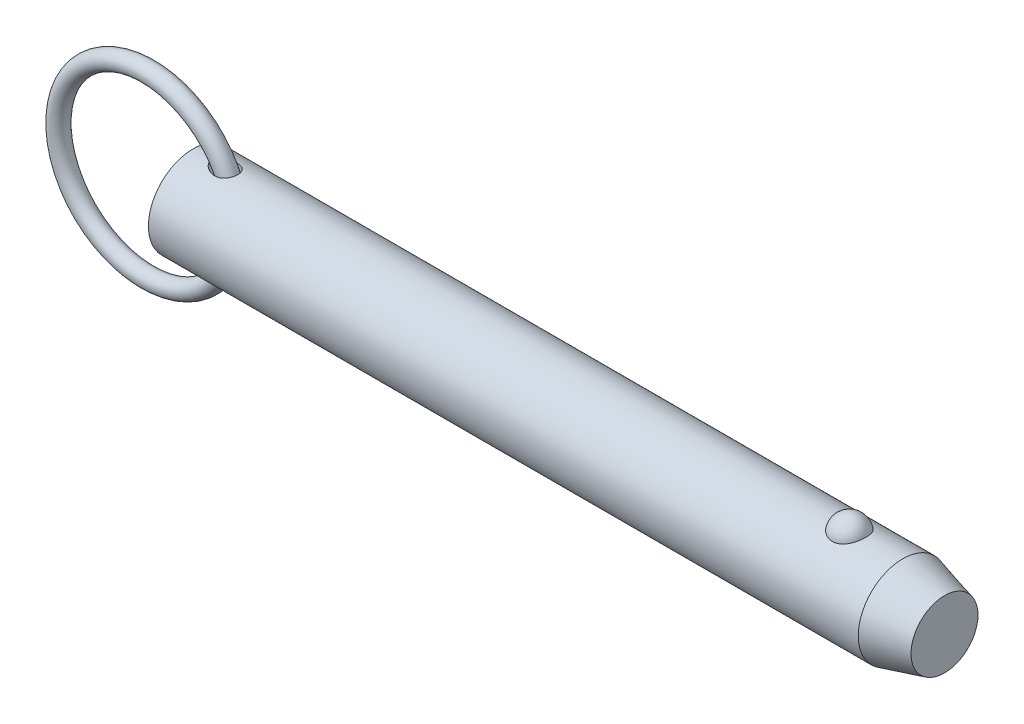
ISO-10303-21;
HEADER;
FILE_DESCRIPTION(('STEP AP214'),'2;1');
FILE_NAME('part.step','',(''),(''),'','','');
FILE_SCHEMA(('AUTOMOTIVE_DESIGN { 1 0 10303 214 1 1 1 1 }'));
ENDSEC;
DATA;
#1=APPLICATION_CONTEXT('core data for automotive mechanical design processes');
#2=APPLICATION_PROTOCOL_DEFINITION('international standard','automotive_design',2000,#1);
#3=PRODUCT_CONTEXT('',#1,'mechanical');
#4=PRODUCT('Part','Part','',(#3));
#5=PRODUCT_RELATED_PRODUCT_CATEGORY('part','',(#4));
#6=PRODUCT_DEFINITION_FORMATION('','',#4);
#7=PRODUCT_DEFINITION_CONTEXT('part definition',#1,'design');
#8=PRODUCT_DEFINITION('design','',#6,#7);
#9=PRODUCT_DEFINITION_SHAPE('','',#8);
#10=(LENGTH_UNIT() NAMED_UNIT(*) SI_UNIT(.MILLI.,.METRE.));
#11=(NAMED_UNIT(*) PLANE_ANGLE_UNIT() SI_UNIT($,.RADIAN.));
#12=(NAMED_UNIT(*) SI_UNIT($,.STERADIAN.) SOLID_ANGLE_UNIT());
#13=UNCERTAINTY_MEASURE_WITH_UNIT(LENGTH_MEASURE(1.E-05),#10,'distance_accuracy_value','');
#14=(GEOMETRIC_REPRESENTATION_CONTEXT(3) GLOBAL_UNCERTAINTY_ASSIGNED_CONTEXT((#13)) GLOBAL_UNIT_ASSIGNED_CONTEXT((#10,
#11,#12)) REPRESENTATION_CONTEXT('',''));
#15=CARTESIAN_POINT('',(0.,0.,0.));
#16=DIRECTION('',(0.,0.,1.));
#17=DIRECTION('',(1.,0.,0.));
#18=AXIS2_PLACEMENT_3D('',#15,#16,#17);
#19=CARTESIAN_POINT('',(-9.66825126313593,0.,0.));
#20=DIRECTION('',(0.,0.,1.));
#21=DIRECTION('',(1.,0.,0.));
#22=AXIS2_PLACEMENT_3D('',#19,#20,#21);
#23=TOROIDAL_SURFACE('',#22,19.05,1.905);
#24=CARTESIAN_POINT('',(11.2867487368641,0.,0.));
#25=VERTEX_POINT('',#24);
#26=VERTEX_LOOP('',#25);
#27=FACE_BOUND('',#26,.T.);
#28=ADVANCED_FACE('P0_F12',(#27),#23,.T.);
#29=CLOSED_SHELL('',(#28));
#30=MANIFOLD_SOLID_BREP('P0_B1',#29);
#31=CARTESIAN_POINT('',(0.,0.,0.));
#32=DIRECTION('',(1.,0.,0.));
#33=DIRECTION('',(0.,0.,-1.));
#34=AXIS2_PLACEMENT_3D('',#31,#32,#33);
#35=CYLINDRICAL_SURFACE('',#34,9.525);
#36=CARTESIAN_POINT('',(4.5669340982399,9.4314194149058,-1.33189820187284));
#37=CARTESIAN_POINT('',(4.70260475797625,9.41020313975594,-1.48215931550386));
#38=CARTESIAN_POINT('',(4.85555680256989,9.38755003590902,-1.61683982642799));
#39=CARTESIAN_POINT('',(5.10171959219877,9.35450554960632,-1.79512943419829));
#40=CARTESIAN_POINT('',(5.18674514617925,9.34362629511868,-1.85068909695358));
#41=CARTESIAN_POINT('',(5.3615438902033,9.32258514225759,-1.95392002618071));
#42=CARTESIAN_POINT('',(5.45131542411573,9.31242299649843,-2.00159402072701));
#43=CARTESIAN_POINT('',(5.70070211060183,9.28632120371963,-2.12033289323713));
#44=CARTESIAN_POINT('',(5.86420408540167,9.2714693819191,-2.18362944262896));
#45=CARTESIAN_POINT('',(6.19893345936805,9.24694163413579,-2.28525783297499));
#46=CARTESIAN_POINT('',(6.37015384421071,9.23726110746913,-2.32361187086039));
#47=CARTESIAN_POINT('',(6.73531776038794,9.22400982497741,-2.37575048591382));
#48=CARTESIAN_POINT('',(6.92975826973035,9.22118808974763,-2.38652934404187));
#49=CARTESIAN_POINT('',(7.21995443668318,9.22416297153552,-2.37494980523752));
#50=CARTESIAN_POINT('',(7.31643847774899,9.22635560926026,-2.366466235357));
#51=CARTESIAN_POINT('',(7.50796421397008,9.2331428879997,-2.33985028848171));
#52=CARTESIAN_POINT('',(7.6030065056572,9.23773650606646,-2.32172202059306));
#53=CARTESIAN_POINT('',(7.83273114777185,9.25183311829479,-2.26504721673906));
#54=CARTESIAN_POINT('',(7.96603028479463,9.26261470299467,-2.2209856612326));
#55=CARTESIAN_POINT('',(8.22310899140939,9.28816519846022,-2.11157306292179));
#56=CARTESIAN_POINT('',(8.34689477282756,9.30293147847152,-2.04623606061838));
#57=CARTESIAN_POINT('',(8.58136049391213,9.3349416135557,-1.89485344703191));
#58=CARTESIAN_POINT('',(8.69199721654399,9.35219324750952,-1.80874222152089));
#59=CARTESIAN_POINT('',(8.89592093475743,9.38707016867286,-1.6179918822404));
#60=CARTESIAN_POINT('',(8.98920771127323,9.40469546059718,-1.51335253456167));
#61=CARTESIAN_POINT('',(9.15057731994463,9.43713590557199,-1.29519427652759));
#62=CARTESIAN_POINT('',(9.21980158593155,9.45205440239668,-1.18253282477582));
#63=CARTESIAN_POINT('',(9.33826736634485,9.47856708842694,-0.946802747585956));
#64=CARTESIAN_POINT('',(9.38751161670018,9.49016173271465,-0.823735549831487));
#65=CARTESIAN_POINT('',(9.46423850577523,9.50859378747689,-0.572614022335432));
#66=CARTESIAN_POINT('',(9.49202393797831,9.5154972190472,-0.444656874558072));
#67=CARTESIAN_POINT('',(9.52636926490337,9.5240690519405,-0.18575268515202));
#68=CARTESIAN_POINT('',(9.53292923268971,9.52573747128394,-0.0548056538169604));
#69=CARTESIAN_POINT('',(9.52467276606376,9.52365852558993,0.206503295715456));
#70=CARTESIAN_POINT('',(9.50983454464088,9.51990564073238,0.33686448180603));
#71=CARTESIAN_POINT('',(9.45907362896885,9.50737852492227,0.593166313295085));
#72=CARTESIAN_POINT('',(9.42315106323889,9.49860432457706,0.719106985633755));
#73=CARTESIAN_POINT('',(9.33106648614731,9.4769892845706,0.962959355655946));
#74=CARTESIAN_POINT('',(9.27490839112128,9.46414923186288,1.08087260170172));
#75=CARTESIAN_POINT('',(9.14375803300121,9.43581000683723,1.30534632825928));
#76=CARTESIAN_POINT('',(9.06876720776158,9.42031103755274,1.41190767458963));
#77=CARTESIAN_POINT('',(8.90203187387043,9.38836719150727,1.61069439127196));
#78=CARTESIAN_POINT('',(8.81029913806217,9.37192298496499,1.70292975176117));
#79=CARTESIAN_POINT('',(8.61268775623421,9.33985045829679,1.87086859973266));
#80=CARTESIAN_POINT('',(8.50680947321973,9.3242221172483,1.94657251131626));
#81=CARTESIAN_POINT('',(8.28220546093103,9.29513431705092,2.08109032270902));
#82=CARTESIAN_POINT('',(8.16329919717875,9.28171415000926,2.13961034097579));
#83=CARTESIAN_POINT('',(7.91756052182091,9.25859072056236,2.23755716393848));
#84=CARTESIAN_POINT('',(7.79072606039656,9.24888842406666,2.27697900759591));
#85=CARTESIAN_POINT('',(7.52377913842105,9.23338749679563,2.33907806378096));
#86=CARTESIAN_POINT('',(7.38334767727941,9.22789571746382,2.36044900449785));
#87=CARTESIAN_POINT('',(7.10081394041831,9.22210229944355,2.3829751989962));
#88=CARTESIAN_POINT('',(6.95871103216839,9.22180269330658,2.38412253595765));
#89=CARTESIAN_POINT('',(6.65642691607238,9.22632724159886,2.36656230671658));
#90=CARTESIAN_POINT('',(6.49641694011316,9.23185415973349,2.3451317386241));
#91=CARTESIAN_POINT('',(6.18115433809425,9.24811737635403,2.28014143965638));
#92=CARTESIAN_POINT('',(6.02590710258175,9.25885936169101,2.23655754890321));
#93=CARTESIAN_POINT('',(5.69904720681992,9.28624254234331,2.12025087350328));
#94=CARTESIAN_POINT('',(5.52873601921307,9.30354853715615,2.04400672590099));
#95=CARTESIAN_POINT('',(5.20289495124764,9.34106989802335,1.86504730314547));
#96=CARTESIAN_POINT('',(5.04735968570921,9.36128419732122,1.76234172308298));
#97=CARTESIAN_POINT('',(4.7928712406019,9.39697639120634,1.55895334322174));
#98=CARTESIAN_POINT('',(4.68938704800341,9.41240250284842,1.46392900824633));
#99=CARTESIAN_POINT('',(4.4984714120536,9.44202586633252,1.25875918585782));
#100=CARTESIAN_POINT('',(4.41101129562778,9.45622528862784,1.1486413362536));
#101=CARTESIAN_POINT('',(4.27502257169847,9.47888210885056,0.940600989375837));
#102=CARTESIAN_POINT('',(4.22216329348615,9.48791121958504,0.84558680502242));
#103=CARTESIAN_POINT('',(4.1324147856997,9.50344321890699,0.648051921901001));
#104=CARTESIAN_POINT('',(4.0955118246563,9.50994827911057,0.545537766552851));
#105=CARTESIAN_POINT('',(4.04043124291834,9.51971586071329,0.334452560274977));
#106=CARTESIAN_POINT('',(4.02240728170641,9.52295176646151,0.22583927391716));
#107=CARTESIAN_POINT('',(4.00750873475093,9.52562364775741,0.00713006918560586));
#108=CARTESIAN_POINT('',(4.01062334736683,9.52506156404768,-0.102965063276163));
#109=CARTESIAN_POINT('',(4.03592967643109,9.52053221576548,-0.306944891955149));
#110=CARTESIAN_POINT('',(4.05571676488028,9.51699426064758,-0.401151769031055));
#111=CARTESIAN_POINT('',(4.10967975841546,9.5074546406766,-0.585176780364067));
#112=CARTESIAN_POINT('',(4.1438599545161,9.50145224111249,-0.674993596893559));
#113=CARTESIAN_POINT('',(4.23261356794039,9.48611703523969,-0.866116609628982));
#114=CARTESIAN_POINT('',(4.28990016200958,9.47635800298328,-0.966121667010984));
#115=CARTESIAN_POINT('',(4.41856577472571,9.45502867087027,-1.15640011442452));
#116=CARTESIAN_POINT('',(4.48996918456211,9.44345524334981,-1.24665623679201));
#117=CARTESIAN_POINT('',(4.5669340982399,9.4314194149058,-1.33189820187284));
#118=B_SPLINE_CURVE_WITH_KNOTS('',3,(#36,#37,#38,#39,#40,#41,#42,#43,#44,#45,#46,#47,#48,#49,
#50,#51,#52,#53,#54,#55,#56,#57,#58,#59,#60,#61,#62,#63,#64,#65,#66,#67,#68,#69,#70,#71,#72,#73,
#74,#75,#76,#77,#78,#79,#80,#81,#82,#83,#84,#85,#86,#87,#88,#89,#90,#91,#92,#93,#94,#95,#96,#97,
#98,#99,#100,#101,#102,#103,#104,#105,#106,#107,#108,#109,#110,#111,#112,#113,#114,#115,#116,
#117),.UNSPECIFIED.,.T.,.F.,(4,2,2,2,2,2,2,2,2,2,2,2,2,2,2,2,2,2,2,2,2,2,2,2,2,2,2,2,2,2,2,2,2,
2,2,2,2,2,2,2,4),(0.,0.609951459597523,0.916123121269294,1.22218863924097,1.74791337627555,
2.27316961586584,2.85362722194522,3.14383229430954,3.43391382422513,3.85437497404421,
4.27455920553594,4.69608835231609,5.11762282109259,5.5149005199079,5.91212379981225,
6.30363414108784,6.69514313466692,7.08705103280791,7.47895654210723,7.87078624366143,
8.26258603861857,8.65411137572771,9.04562666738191,9.44349251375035,9.84146165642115,
10.2662286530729,10.6911619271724,11.1739180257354,11.6572017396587,12.2170157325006,
12.776624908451,13.1992556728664,13.6211226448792,13.9471990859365,14.2729943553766,
14.6014211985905,14.9296802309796,15.2173810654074,15.505167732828,15.8505863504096,
16.1966070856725),.UNSPECIFIED.);
#119=CARTESIAN_POINT('',(4.5669340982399,9.4314194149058,-1.33189820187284));
#120=VERTEX_POINT('',#119);
#121=EDGE_CURVE('P1_E40',#120,#120,#118,.T.);
#122=ORIENTED_EDGE('',*,*,#121,.T.);
#123=EDGE_LOOP('',(#122));
#124=FACE_BOUND('',#123,.T.);
#125=CARTESIAN_POINT('',(151.443054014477,0.,0.));
#126=DIRECTION('',(1.,0.,0.));
#127=DIRECTION('',(0.,0.,-1.));
#128=AXIS2_PLACEMENT_3D('',#125,#126,#127);
#129=CIRCLE('',#128,9.525);
#130=CARTESIAN_POINT('',(151.443054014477,0.,-9.525));
#131=VERTEX_POINT('',#130);
#132=EDGE_CURVE('P1_E25',#131,#131,#129,.T.);
#133=ORIENTED_EDGE('',*,*,#132,.F.);
#134=EDGE_LOOP('',(#133));
#135=FACE_BOUND('',#134,.T.);
#136=CARTESIAN_POINT('',(0.,0.,0.));
#137=DIRECTION('',(1.,0.,0.));
#138=DIRECTION('',(0.,0.,-1.));
#139=AXIS2_PLACEMENT_3D('',#136,#137,#138);
#140=CIRCLE('',#139,9.525);
#141=CARTESIAN_POINT('',(0.,0.,-9.525));
#142=VERTEX_POINT('',#141);
#143=EDGE_CURVE('P1_E9',#142,#142,#140,.T.);
#144=ORIENTED_EDGE('',*,*,#143,.T.);
#145=EDGE_LOOP('',(#144));
#146=FACE_BOUND('',#145,.T.);
#147=CARTESIAN_POINT('',(140.045757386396,8.80405803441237,3.63513233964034));
#148=CARTESIAN_POINT('',(139.951676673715,8.80405953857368,3.63513053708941));
#149=CARTESIAN_POINT('',(139.857561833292,8.80561325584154,3.63137461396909));
#150=CARTESIAN_POINT('',(139.670012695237,8.81177748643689,3.61638665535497));
#151=CARTESIAN_POINT('',(139.576578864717,8.81638992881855,3.60514990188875));
#152=CARTESIAN_POINT('',(139.297945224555,8.83467114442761,3.56024627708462));
#153=CARTESIAN_POINT('',(139.114691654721,8.85278327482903,3.51538626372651));
#154=CARTESIAN_POINT('',(138.759509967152,8.89871214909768,3.39742145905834));
#155=CARTESIAN_POINT('',(138.587553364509,8.92650327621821,3.32439116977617));
#156=CARTESIAN_POINT('',(138.258707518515,8.98874819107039,3.15220244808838));
#157=CARTESIAN_POINT('',(138.101811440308,9.02319893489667,3.05305594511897));
#158=CARTESIAN_POINT('',(137.802214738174,9.09629186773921,2.82797815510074));
#159=CARTESIAN_POINT('',(137.660060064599,9.13502685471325,2.70135138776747));
#160=CARTESIAN_POINT('',(137.398299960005,9.21186572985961,2.42641932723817));
#161=CARTESIAN_POINT('',(137.278701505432,9.24996941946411,2.2781073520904));
#162=CARTESIAN_POINT('',(137.059645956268,9.32341082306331,1.95652290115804));
#163=CARTESIAN_POINT('',(136.961317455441,9.35855090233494,1.78243511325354));
#164=CARTESIAN_POINT('',(136.793819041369,9.42045142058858,1.419372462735));
#165=CARTESIAN_POINT('',(136.724651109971,9.44721128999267,1.23039658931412));
#166=CARTESIAN_POINT('',(136.616199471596,9.48990641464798,0.84037088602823));
#167=CARTESIAN_POINT('',(136.577288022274,9.50570658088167,0.639202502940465));
#168=CARTESIAN_POINT('',(136.531555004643,9.52433146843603,0.232664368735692));
#169=CARTESIAN_POINT('',(136.524732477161,9.52715657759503,0.0272947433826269));
#170=CARTESIAN_POINT('',(136.543255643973,9.51956918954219,-0.380478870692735));
#171=CARTESIAN_POINT('',(136.568405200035,9.50923740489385,-0.582893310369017));
#172=CARTESIAN_POINT('',(136.65002537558,9.47651897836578,-0.980293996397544));
#173=CARTESIAN_POINT('',(136.706496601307,9.45413210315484,-1.17528009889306));
#174=CARTESIAN_POINT('',(136.849719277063,9.39954044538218,-1.55263697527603));
#175=CARTESIAN_POINT('',(136.936512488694,9.36732213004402,-1.73498993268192));
#176=CARTESIAN_POINT('',(137.138610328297,9.29640700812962,-2.08177763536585));
#177=CARTESIAN_POINT('',(137.253917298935,9.25770966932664,-2.24621090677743));
#178=CARTESIAN_POINT('',(137.511264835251,9.17775604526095,-2.55338333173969));
#179=CARTESIAN_POINT('',(137.653434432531,9.13648808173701,-2.69601150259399));
#180=CARTESIAN_POINT('',(137.96089985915,9.05620497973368,-2.95451229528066));
#181=CARTESIAN_POINT('',(138.126193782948,9.01718965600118,-3.070387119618));
#182=CARTESIAN_POINT('',(138.472052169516,8.94680019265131,-3.26976836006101));
#183=CARTESIAN_POINT('',(138.652227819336,8.91528408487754,-3.35389750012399));
#184=CARTESIAN_POINT('',(139.025651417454,8.86272514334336,-3.49043503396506));
#185=CARTESIAN_POINT('',(139.218894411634,8.84167836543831,-3.54285537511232));
#186=CARTESIAN_POINT('',(139.602503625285,8.81348056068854,-3.61241306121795));
#187=CARTESIAN_POINT('',(139.792525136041,8.80568348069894,-3.6311933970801));
#188=CARTESIAN_POINT('',(140.173190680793,8.80289410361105,-3.63795342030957));
#189=CARTESIAN_POINT('',(140.363834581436,8.80789922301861,-3.62593932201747));
#190=CARTESIAN_POINT('',(140.734007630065,8.82974915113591,-3.57238430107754));
#191=CARTESIAN_POINT('',(140.913697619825,8.84621463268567,-3.53178890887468));
#192=CARTESIAN_POINT('',(141.263422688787,8.88875330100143,-3.42331083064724));
#193=CARTESIAN_POINT('',(141.433456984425,8.91482726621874,-3.35542593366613));
#194=CARTESIAN_POINT('',(141.763237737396,8.97448239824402,-3.19248225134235));
#195=CARTESIAN_POINT('',(141.922680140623,9.00821446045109,-3.0968647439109));
#196=CARTESIAN_POINT('',(142.223513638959,9.07935398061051,-2.88162736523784));
#197=CARTESIAN_POINT('',(142.364900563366,9.11676228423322,-2.76200196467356));
#198=CARTESIAN_POINT('',(142.63331931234,9.19347419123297,-2.49516285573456));
#199=CARTESIAN_POINT('',(142.759275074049,9.23277872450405,-2.34686614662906));
#200=CARTESIAN_POINT('',(142.985522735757,9.30737610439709,-2.03093683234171));
#201=CARTESIAN_POINT('',(143.08581004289,9.34266823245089,-1.86330077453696));
#202=CARTESIAN_POINT('',(143.261514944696,9.40674710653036,-1.50744893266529));
#203=CARTESIAN_POINT('',(143.336041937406,9.43529176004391,-1.31874876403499));
#204=CARTESIAN_POINT('',(143.45416505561,9.48144132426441,-0.930631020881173));
#205=CARTESIAN_POINT('',(143.497760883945,9.49904612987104,-0.731213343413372));
#206=CARTESIAN_POINT('',(143.553158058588,9.5215314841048,-0.327147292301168));
#207=CARTESIAN_POINT('',(143.564935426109,9.52640243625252,-0.122495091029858));
#208=CARTESIAN_POINT('',(143.556382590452,9.5228957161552,0.286018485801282));
#209=CARTESIAN_POINT('',(143.53605305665,9.5145183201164,0.489879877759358));
#210=CARTESIAN_POINT('',(143.463884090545,9.48544083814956,0.889994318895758));
#211=CARTESIAN_POINT('',(143.412199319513,9.46480124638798,1.08627971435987));
#212=CARTESIAN_POINT('',(143.278491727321,9.4133389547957,1.46682086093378));
#213=CARTESIAN_POINT('',(143.196466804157,9.38251554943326,1.65107577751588));
#214=CARTESIAN_POINT('',(143.00319292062,9.31365636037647,2.00346348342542));
#215=CARTESIAN_POINT('',(142.891783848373,9.27558138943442,2.17150083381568));
#216=CARTESIAN_POINT('',(142.642294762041,9.19638714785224,2.48563115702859));
#217=CARTESIAN_POINT('',(142.504216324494,9.15526805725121,2.63172542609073));
#218=CARTESIAN_POINT('',(142.204843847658,9.07465393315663,2.89750997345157));
#219=CARTESIAN_POINT('',(142.043610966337,9.03515496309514,3.01726776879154));
#220=CARTESIAN_POINT('',(141.701613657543,8.96227564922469,3.22732920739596));
#221=CARTESIAN_POINT('',(141.520841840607,8.92889763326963,3.31762165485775));
#222=CARTESIAN_POINT('',(141.151445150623,8.8734538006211,3.46314419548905));
#223=CARTESIAN_POINT('',(140.96332371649,8.85102983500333,3.51950082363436));
#224=CARTESIAN_POINT('',(140.67578699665,8.8266696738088,3.57993683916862));
#225=CARTESIAN_POINT('',(140.579133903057,8.82009725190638,3.5960621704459));
#226=CARTESIAN_POINT('',(140.384677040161,8.81020897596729,3.62022512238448));
#227=CARTESIAN_POINT('',(140.286874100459,8.80689090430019,3.62826825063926));
#228=CARTESIAN_POINT('',(140.141224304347,8.80445615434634,3.63416760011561));
#229=CARTESIAN_POINT('',(140.093495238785,8.80405727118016,3.63513325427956));
#230=CARTESIAN_POINT('',(140.045757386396,8.80405803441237,3.63513233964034));
#231=B_SPLINE_CURVE_WITH_KNOTS('',3,(#147,#148,#149,#150,#151,#152,#153,#154,#155,#156,#157,
#158,#159,#160,#161,#162,#163,#164,#165,#166,#167,#168,#169,#170,#171,#172,#173,#174,#175,#176,
#177,#178,#179,#180,#181,#182,#183,#184,#185,#186,#187,#188,#189,#190,#191,#192,#193,#194,#195,
#196,#197,#198,#199,#200,#201,#202,#203,#204,#205,#206,#207,#208,#209,#210,#211,#212,#213,#214,
#215,#216,#217,#218,#219,#220,#221,#222,#223,#224,#225,#226,#227,#228,#229,#230),.UNSPECIFIED.,
.T.,.F.,(4,2,2,2,2,2,2,2,2,2,2,2,2,2,2,2,2,2,2,2,2,2,2,2,2,2,2,2,2,2,2,2,2,2,2,2,2,2,2,2,2,4),
(0.,0.282202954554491,0.564584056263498,1.13017050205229,1.69427128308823,2.25811483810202,
2.83836627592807,3.41879688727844,4.02497117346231,4.63118665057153,5.24474754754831,
5.85829010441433,6.46808687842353,7.07789545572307,7.6885472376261,8.299249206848,
8.91296283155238,9.52662591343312,10.1275338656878,10.7282152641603,11.2986646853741,
11.8689989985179,12.4213015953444,12.973648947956,13.5380053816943,14.1024919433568,
14.6952986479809,15.2882113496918,15.8999469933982,16.5116885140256,17.1238909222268,
17.7360805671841,18.3452748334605,18.9545113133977,19.567138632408,20.179729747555,
20.7907316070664,21.4019653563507,21.9915938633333,22.2859053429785,22.5800161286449,
22.7232098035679),.UNSPECIFIED.);
#232=CARTESIAN_POINT('',(140.045757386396,8.80405803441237,3.63513233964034));
#233=VERTEX_POINT('',#232);
#234=EDGE_CURVE('P1_E34',#233,#233,#231,.T.);
#235=ORIENTED_EDGE('',*,*,#234,.T.);
#236=EDGE_LOOP('',(#235));
#237=FACE_BOUND('',#236,.T.);
#238=CARTESIAN_POINT('',(4.5669340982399,-9.4314194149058,-1.33189820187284));
#239=CARTESIAN_POINT('',(4.48932984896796,-9.4435553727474,-1.24594548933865));
#240=CARTESIAN_POINT('',(4.41737309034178,-9.45522193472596,-1.1548795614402));
#241=CARTESIAN_POINT('',(4.28781047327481,-9.47670896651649,-0.962782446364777));
#242=CARTESIAN_POINT('',(4.23019403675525,-9.48653079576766,-0.861758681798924));
#243=CARTESIAN_POINT('',(4.132545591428,-9.5034118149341,-0.649723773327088));
#244=CARTESIAN_POINT('',(4.09271158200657,-9.51043980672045,-0.538615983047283));
#245=CARTESIAN_POINT('',(4.04973167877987,-9.51806966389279,-0.367764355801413));
#246=CARTESIAN_POINT('',(4.03820037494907,-9.52012756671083,-0.310118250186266));
#247=CARTESIAN_POINT('',(4.02100287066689,-9.52320274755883,-0.193935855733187));
#248=CARTESIAN_POINT('',(4.0153356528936,-9.52422020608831,-0.135399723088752));
#249=CARTESIAN_POINT('',(4.0081707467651,-9.52550497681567,0.0247266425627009));
#250=CARTESIAN_POINT('',(4.0127049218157,-9.52468821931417,0.126661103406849));
#251=CARTESIAN_POINT('',(4.03954973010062,-9.51988506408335,0.328012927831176));
#252=CARTESIAN_POINT('',(4.06186450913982,-9.51589792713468,0.427429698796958));
#253=CARTESIAN_POINT('',(4.12088980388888,-9.50548528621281,0.616362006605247));
#254=CARTESIAN_POINT('',(4.15684838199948,-9.49918763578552,0.706123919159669));
#255=CARTESIAN_POINT('',(4.24094647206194,-9.48470618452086,0.87952277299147));
#256=CARTESIAN_POINT('',(4.28909090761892,-9.47652162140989,0.963157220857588));
#257=CARTESIAN_POINT('',(4.42295891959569,-9.45426317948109,1.16513741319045));
#258=CARTESIAN_POINT('',(4.51523752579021,-9.43933320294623,1.27905352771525));
#259=CARTESIAN_POINT('',(4.71682295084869,-9.40825940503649,1.49055892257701));
#260=CARTESIAN_POINT('',(4.82617286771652,-9.39211256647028,1.58810554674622));
#261=CARTESIAN_POINT('',(5.09064226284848,-9.35555264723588,1.79246125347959));
#262=CARTESIAN_POINT('',(5.2499041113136,-9.33524115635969,1.89393122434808));
#263=CARTESIAN_POINT('',(5.58309255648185,-9.29785396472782,2.06968659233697));
#264=CARTESIAN_POINT('',(5.75702897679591,-9.28078045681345,2.14395359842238));
#265=CARTESIAN_POINT('',(6.11646882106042,-9.25213303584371,2.26440412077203));
#266=CARTESIAN_POINT('',(6.30205582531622,-9.2406056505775,2.31035092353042));
#267=CARTESIAN_POINT('',(6.67856093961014,-9.22541807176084,2.37029728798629));
#268=CARTESIAN_POINT('',(6.86947045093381,-9.22174585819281,2.38434566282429));
#269=CARTESIAN_POINT('',(7.21217144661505,-9.22344239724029,2.37775005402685));
#270=CARTESIAN_POINT('',(7.36409439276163,-9.22713860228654,2.36352577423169));
#271=CARTESIAN_POINT('',(7.66346227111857,-9.24048072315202,2.31082299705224));
#272=CARTESIAN_POINT('',(7.81090958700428,-9.25012341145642,2.27235765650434));
#273=CARTESIAN_POINT('',(8.09730316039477,-9.2746609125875,2.17003648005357));
#274=CARTESIAN_POINT('',(8.23619652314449,-9.28958517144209,2.10603803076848));
#275=CARTESIAN_POINT('',(8.49918675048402,-9.32290326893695,1.95324442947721));
#276=CARTESIAN_POINT('',(8.62328895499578,-9.34129584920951,1.86445826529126));
#277=CARTESIAN_POINT('',(8.84006515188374,-9.37706953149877,1.67466761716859));
#278=CARTESIAN_POINT('',(8.93465172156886,-9.39436331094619,1.57582357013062));
#279=CARTESIAN_POINT('',(9.10490234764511,-9.42761680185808,1.36280955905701));
#280=CARTESIAN_POINT('',(9.18057146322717,-9.44357686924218,1.24864370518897));
#281=CARTESIAN_POINT('',(9.30789178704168,-9.47159985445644,1.01379272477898));
#282=CARTESIAN_POINT('',(9.36045544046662,-9.48380365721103,0.893617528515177));
#283=CARTESIAN_POINT('',(9.44498362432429,-9.50388751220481,0.64589020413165));
#284=CARTESIAN_POINT('',(9.47694947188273,-9.51176784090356,0.518338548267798));
#285=CARTESIAN_POINT('',(9.51944262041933,-9.52232073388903,0.260103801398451));
#286=CARTESIAN_POINT('',(9.53006646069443,-9.52501674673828,0.129437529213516));
#287=CARTESIAN_POINT('',(9.52993291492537,-9.52498309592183,-0.131885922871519));
#288=CARTESIAN_POINT('',(9.51917525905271,-9.52225336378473,-0.262543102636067));
#289=CARTESIAN_POINT('',(9.47648788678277,-9.51165418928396,-0.520312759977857));
#290=CARTESIAN_POINT('',(9.44453086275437,-9.50377811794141,-0.647420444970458));
#291=CARTESIAN_POINT('',(9.36015568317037,-9.48373425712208,-0.894290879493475));
#292=CARTESIAN_POINT('',(9.30773827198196,-9.47156662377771,-1.01405389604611));
#293=CARTESIAN_POINT('',(9.18380895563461,-9.44428888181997,-1.24269386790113));
#294=CARTESIAN_POINT('',(9.11232064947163,-9.42918241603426,-1.35158405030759));
#295=CARTESIAN_POINT('',(8.9521268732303,-9.39767706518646,-1.55562459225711));
#296=CARTESIAN_POINT('',(8.86342281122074,-9.3812782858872,-1.65077607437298));
#297=CARTESIAN_POINT('',(8.67104443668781,-9.34891827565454,-1.8251751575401));
#298=CARTESIAN_POINT('',(8.56732858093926,-9.33295841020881,-1.90437711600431));
#299=CARTESIAN_POINT('',(8.3481843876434,-9.30317889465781,-2.0449122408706));
#300=CARTESIAN_POINT('',(8.23275529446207,-9.28935938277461,-2.10624425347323));
#301=CARTESIAN_POINT('',(7.9896124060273,-9.26475003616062,-2.2120340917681));
#302=CARTESIAN_POINT('',(7.86162088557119,-9.25407358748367,-2.25587700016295));
#303=CARTESIAN_POINT('',(7.60027499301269,-9.23720810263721,-2.32397032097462));
#304=CARTESIAN_POINT('',(7.46691858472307,-9.23102078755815,-2.34821321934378));
#305=CARTESIAN_POINT('',(7.18516230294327,-9.22302718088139,-2.37943079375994));
#306=CARTESIAN_POINT('',(7.03654454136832,-9.22169704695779,-2.38452997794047));
#307=CARTESIAN_POINT('',(6.74015049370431,-9.22442327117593,-2.37395141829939));
#308=CARTESIAN_POINT('',(6.5923745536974,-9.22848170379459,-2.35826567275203));
#309=CARTESIAN_POINT('',(6.27762777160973,-9.2422287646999,-2.30385559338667));
#310=CARTESIAN_POINT('',(6.11124715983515,-9.25269504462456,-2.26192683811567));
#311=CARTESIAN_POINT('',(5.78635920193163,-9.27830776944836,-2.15445569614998));
#312=CARTESIAN_POINT('',(5.62786567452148,-9.29346211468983,-2.08887341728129));
#313=CARTESIAN_POINT('',(5.39013065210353,-9.31931237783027,-1.96924953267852));
#314=CARTESIAN_POINT('',(5.30683088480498,-9.32901725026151,-1.92292485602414));
#315=CARTESIAN_POINT('',(5.14455801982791,-9.34899035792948,-1.82334419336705));
#316=CARTESIAN_POINT('',(5.06558607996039,-9.35925874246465,-1.77008636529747));
#317=CARTESIAN_POINT('',(4.83670950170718,-9.39034445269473,-1.60010986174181));
#318=CARTESIAN_POINT('',(4.69422471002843,-9.41151337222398,-1.47288240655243));
#319=CARTESIAN_POINT('',(4.5669340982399,-9.4314194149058,-1.33189820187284));
#320=B_SPLINE_CURVE_WITH_KNOTS('',3,(#238,#239,#240,#241,#242,#243,#244,#245,#246,#247,#248,
#249,#250,#251,#252,#253,#254,#255,#256,#257,#258,#259,#260,#261,#262,#263,#264,#265,#266,#267,
#268,#269,#270,#271,#272,#273,#274,#275,#276,#277,#278,#279,#280,#281,#282,#283,#284,#285,#286,
#287,#288,#289,#290,#291,#292,#293,#294,#295,#296,#297,#298,#299,#300,#301,#302,#303,#304,#305,
#306,#307,#308,#309,#310,#311,#312,#313,#314,#315,#316,#317,#318,#319),.UNSPECIFIED.,.T.,.F.,(4,
2,2,2,2,2,2,2,2,2,2,2,2,2,2,2,2,2,2,2,2,2,2,2,2,2,2,2,2,2,2,2,2,2,2,2,2,2,2,2,4),(0.,
0.348900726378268,0.697543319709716,1.0499765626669,1.22617690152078,1.40234666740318,
1.70666745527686,2.01105922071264,2.30066493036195,2.59038784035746,3.03001384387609,
3.47076822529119,4.03766594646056,4.60494622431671,5.17690598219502,5.74798989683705,
6.20400848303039,6.65977977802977,7.11813321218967,7.57632066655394,7.98791759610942,
8.39940433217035,8.79273459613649,9.18603970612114,9.57756168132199,9.96908859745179,
10.3611208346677,10.7531388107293,11.1446739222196,11.536177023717,11.9287850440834,
12.3214184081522,12.7268448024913,13.1324265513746,13.5768390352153,14.0214226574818,
14.5351685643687,15.0497849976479,15.3368801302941,15.6240516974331,16.1963372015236),.UNSPECIFIED.);
#321=CARTESIAN_POINT('',(4.5669340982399,-9.4314194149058,-1.33189820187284));
#322=VERTEX_POINT('',#321);
#323=EDGE_CURVE('P1_E17',#322,#322,#320,.T.);
#324=ORIENTED_EDGE('',*,*,#323,.T.);
#325=EDGE_LOOP('',(#324));
#326=FACE_BOUND('',#325,.T.);
#327=ADVANCED_FACE('P1_F13',(#124,#135,#146,#237,#326),#35,.T.);
#328=CARTESIAN_POINT('',(0.,0.,0.));
#329=DIRECTION('',(-1.,0.,0.));
#330=DIRECTION('',(0.,0.,1.));
#331=AXIS2_PLACEMENT_3D('',#328,#329,#330);
#332=PLANE('',#331);
#333=ORIENTED_EDGE('',*,*,#143,.F.);
#334=EDGE_LOOP('',(#333));
#335=FACE_BOUND('',#334,.T.);
#336=ADVANCED_FACE('P1_F15',(#335),#332,.T.);
#337=CARTESIAN_POINT('',(160.33,0.,0.));
#338=DIRECTION('',(-1.,0.,0.));
#339=DIRECTION('',(0.,0.,1.));
#340=AXIS2_PLACEMENT_3D('',#337,#338,#339);
#341=CONICAL_SURFACE('',#340,7.14375000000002,0.26179938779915);
#342=ORIENTED_EDGE('',*,*,#132,.T.);
#343=EDGE_LOOP('',(#342));
#344=FACE_BOUND('',#343,.T.);
#345=CARTESIAN_POINT('',(160.33,0.,0.));
#346=DIRECTION('',(1.,0.,0.));
#347=DIRECTION('',(0.,0.,-1.));
#348=AXIS2_PLACEMENT_3D('',#345,#346,#347);
#349=CIRCLE('',#348,7.14375000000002);
#350=CARTESIAN_POINT('',(160.33,0.,-7.14375000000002));
#351=VERTEX_POINT('',#350);
#352=EDGE_CURVE('P1_E30',#351,#351,#349,.T.);
#353=ORIENTED_EDGE('',*,*,#352,.F.);
#354=EDGE_LOOP('',(#353));
#355=FACE_BOUND('',#354,.T.);
#356=ADVANCED_FACE('P1_F55',(#344,#355),#341,.T.);
#357=CARTESIAN_POINT('',(160.33,7.14375000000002,0.));
#358=DIRECTION('',(1.,0.,0.));
#359=DIRECTION('',(0.,0.,-1.));
#360=AXIS2_PLACEMENT_3D('',#357,#358,#359);
#361=PLANE('',#360);
#362=ORIENTED_EDGE('',*,*,#352,.T.);
#363=EDGE_LOOP('',(#362));
#364=FACE_BOUND('',#363,.T.);
#365=ADVANCED_FACE('P1_F51',(#364),#361,.T.);
#366=CARTESIAN_POINT('',(140.045757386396,8.5725,0.));
#367=DIRECTION('',(-1.,0.,0.));
#368=DIRECTION('',(0.,1.,0.));
#369=AXIS2_PLACEMENT_3D('',#366,#367,#368);
#370=SPHERICAL_SURFACE('',#369,3.64249999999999);
#371=ORIENTED_EDGE('',*,*,#234,.F.);
#372=EDGE_LOOP('',(#371));
#373=FACE_BOUND('',#372,.T.);
#374=ADVANCED_FACE('P1_F46',(#373),#370,.T.);
#375=CARTESIAN_POINT('',(-9.66825126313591,0.,0.));
#376=DIRECTION('',(0.,0.,1.));
#377=DIRECTION('',(1.,0.,0.));
#378=AXIS2_PLACEMENT_3D('',#375,#376,#377);
#379=TOROIDAL_SURFACE('',#378,19.05,2.38125);
#380=ORIENTED_EDGE('',*,*,#323,.F.);
#381=EDGE_LOOP('',(#380));
#382=FACE_BOUND('',#381,.T.);
#383=ORIENTED_EDGE('',*,*,#121,.F.);
#384=EDGE_LOOP('',(#383));
#385=FACE_BOUND('',#384,.T.);
#386=ADVANCED_FACE('P1_F50',(#382,#385),#379,.F.);
#387=CLOSED_SHELL('',(#327,#336,#356,#365,#374,#386));
#388=MANIFOLD_SOLID_BREP('P1_B1',#387);
#389=ADVANCED_BREP_SHAPE_REPRESENTATION('',(#18,#30,#388),#14);
#390=SHAPE_DEFINITION_REPRESENTATION(#9,#389);
ENDSEC;
END-ISO-10303-21;
